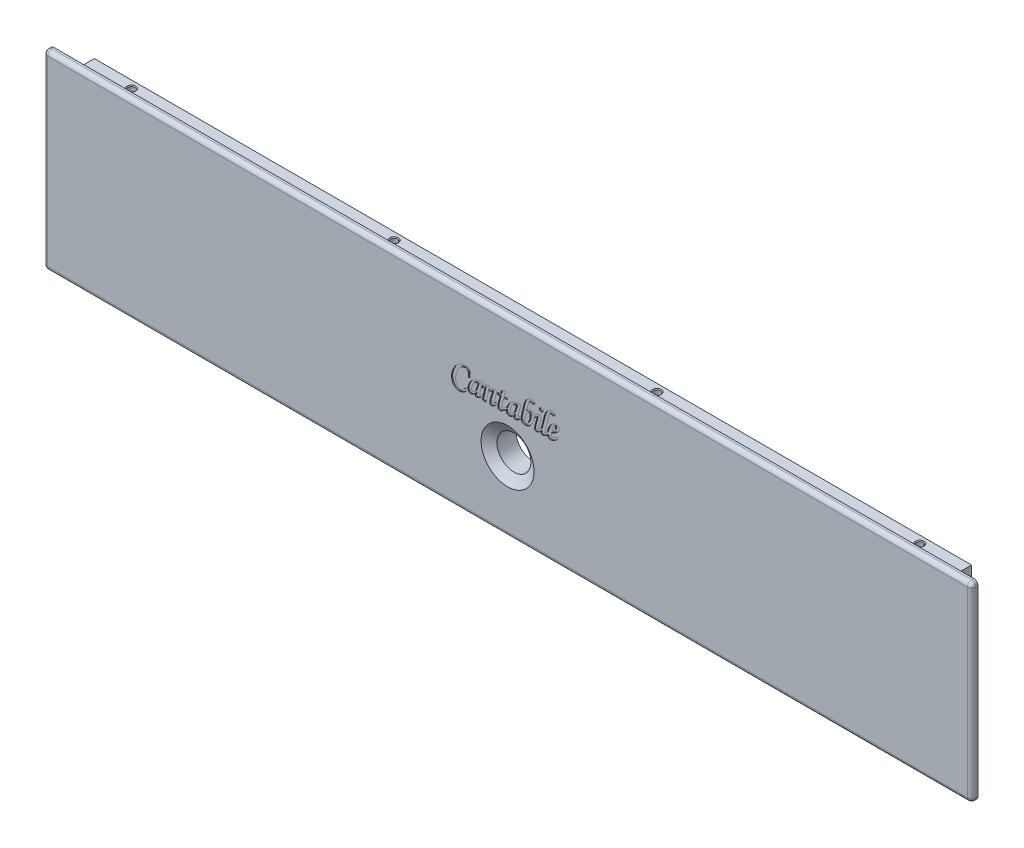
from build123d import *

# Parameters (mm, degrees)
SKETCH_1_W                     = 438
SKETCH_1_H                     = 90
EXTRUDE_1_DEPTH                = 12
SKETCH_3_W                     = 9
SKETCH_3_H                     = 4
CUT_EXTRUDE_1_DEPTH            = 448.311971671
HOLE_WIZARD_M1_6_1_D           = 16
HOLE_WIZARD_M1_6_1_CSINK_D     = 25
HOLE_WIZARD_M1_6_1_CSINK_ANGLE = 112.62
SKETCH_12_W                    = 12
SKETCH_12_H                    = 9
CUT_EXTRUDE_2_DEPTH            = 447.524355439
FILLET_1_R                     = 2
FILLET_2_R                     = 2
HOLE_WIZARD_M4_1_D             = 3.3
HOLE_WIZARD_M4_1_CSINK_D       = 4.05
HOLE_WIZARD_M4_1_CSINK_ANGLE   = 90
HOLE_WIZARD_M4_3_D             = 3.3
HOLE_WIZARD_M4_3_DEPTH         = 7.1
HOLE_WIZARD_M4_3_CSINK_D       = 4.05
HOLE_WIZARD_M4_3_CSINK_ANGLE   = 90
HOLE_WIZARD_M4_3_TIP           = 0.991420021
HOLE_WIZARD_M4_4_D             = 3.3
HOLE_WIZARD_M4_4_DEPTH         = 7.1
HOLE_WIZARD_M4_4_CSINK_D       = 4.05
HOLE_WIZARD_M4_4_CSINK_ANGLE   = 90
HOLE_WIZARD_M4_4_TIP           = 0.991420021
CUT_EXTRUDE_3_DEPTH            = 0.5


with BuildPart() as part:
    # Sketch 1 → Extrude 1 (new body)
    with BuildSketch(Plane.XY):
        with Locations((219, 45)):
            Rectangle(SKETCH_1_W, SKETCH_1_H)
    extrude(amount=EXTRUDE_1_DEPTH)

    # Sketch 3 → Cut-Extrude 1 (cut, through all)
    with BuildSketch(Plane(origin=(438, 0, 0), x_dir=(0, 0, -1), z_dir=(1, 0, 0))):
        with Locations((-4.5, 88)):
            Rectangle(SKETCH_3_W, SKETCH_3_H)
        with Locations((-4.5, 2)):
            Rectangle(SKETCH_3_W, SKETCH_3_H)
    extrude(amount=-CUT_EXTRUDE_1_DEPTH, mode=Mode.SUBTRACT)

    # Hole Wizard M1.6 _1 (through all)
    with Locations(Plane.XY.offset(12)):
        with Locations((219, 33)):
            CounterSinkHole(HOLE_WIZARD_M1_6_1_D / 2, HOLE_WIZARD_M1_6_1_CSINK_D / 2, counter_sink_angle=HOLE_WIZARD_M1_6_1_CSINK_ANGLE)

    # Sketch 12 → Cut-Extrude 2 (cut, through all)
    with BuildSketch(Plane(origin=(0, 86, 0), x_dir=(1, 0, 0), z_dir=(0, 1, 0))):
        with Locations((432, -4.5)):
            Rectangle(SKETCH_12_W, SKETCH_12_H)
        with Locations((6, -4.5)):
            Rectangle(SKETCH_12_W, SKETCH_12_H)
    extrude(amount=-CUT_EXTRUDE_2_DEPTH, mode=Mode.SUBTRACT)

    # Fillet 1
    fillet_1_edges = [part.edges().sort_by_distance(p)[0] for p in [
        (0, 90, 10.5),
        (438, 90, 10.5),
        (438, 0, 10.5),
        (0, 0, 10.5),
    ]]
    fillet(fillet_1_edges, radius=FILLET_1_R)

    # Fillet 2
    fillet_2_edges = [part.edges().sort_by_distance(p)[0] for p in [
        (0, 45, 12),
        (219, 90, 12),
        (219, 0, 12),
        (438, 45, 12),
        (437.414213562, 89.414213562, 12),
        (437.414213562, 0.585786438, 12),
        (0.585786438, 0.585786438, 12),
        (0.585786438, 89.414213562, 12),
    ]]
    fillet(fillet_2_edges, radius=FILLET_2_R)

    # Hole Wizard M4 _1 (through all)
    with Locations(Plane(origin=(0, 86, 0), x_dir=(1, 0, 0), z_dir=(0, 1, 0))):
        with Locations((405, -3.5), (281, -3.5), (157, -3.5), (33, -3.5)):
            CounterSinkHole(HOLE_WIZARD_M4_1_D / 2, HOLE_WIZARD_M4_1_CSINK_D / 2, counter_sink_angle=HOLE_WIZARD_M4_1_CSINK_ANGLE)

    # Hole Wizard M4 _3
    with Locations(Plane.ZY.offset(-12)):
        with Locations((3.5, 70), (3.5, 20)):
            CounterSinkHole(HOLE_WIZARD_M4_3_D / 2, HOLE_WIZARD_M4_3_CSINK_D / 2, depth=HOLE_WIZARD_M4_3_DEPTH, counter_sink_angle=HOLE_WIZARD_M4_3_CSINK_ANGLE)
            with Locations((0, 0, -(HOLE_WIZARD_M4_3_DEPTH + HOLE_WIZARD_M4_3_TIP / 2))):  # 118° drill point
                Cone(0, HOLE_WIZARD_M4_3_D / 2, HOLE_WIZARD_M4_3_TIP, mode=Mode.SUBTRACT)

    # Hole Wizard M4 _4
    with Locations(Plane(origin=(426, 0, 0), x_dir=(0, 0, -1), z_dir=(1, 0, 0))):
        with Locations((-3.5, 20), (-3.5, 70)):
            CounterSinkHole(HOLE_WIZARD_M4_4_D / 2, HOLE_WIZARD_M4_4_CSINK_D / 2, depth=HOLE_WIZARD_M4_4_DEPTH, counter_sink_angle=HOLE_WIZARD_M4_4_CSINK_ANGLE)
            with Locations((0, 0, -(HOLE_WIZARD_M4_4_DEPTH + HOLE_WIZARD_M4_4_TIP / 2))):  # 118° drill point
                Cone(0, HOLE_WIZARD_M4_4_D / 2, HOLE_WIZARD_M4_4_TIP, mode=Mode.SUBTRACT)

    # Sketch 23 → Cut-Extrude 3 (cut)
    # profile 1 of 5: a face of its own
    with BuildSketch(Plane.XY.offset(12)):
        with BuildLine():
            Line((201.30490828, 56.028755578), (200.519087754, 56.028755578))
            add(Edge.make_bspline(
                [(200.519087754, 56.028755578), (200.530581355, 56.265836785), (200.548333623, 56.668943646), (200.558478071, 57.072333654), (200.55875062, 57.23847298)],
                knots=[0, 0, 0, 0, 0.588272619, 1, 1, 1, 1], degree=3))
            add(Edge.make_bspline(
                [(200.55875062, 57.23847298), (200.555646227, 57.410313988), (200.550780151, 57.659691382), (200.498119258, 57.973898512), (200.448908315, 58.177807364), (200.388985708, 58.361507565), (200.30764224, 58.52069806), (200.217394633, 58.662228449), (200.073685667, 58.815623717), (199.870702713, 58.97285679), (199.491133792, 59.153887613), (199.172374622, 59.2017486), (198.957362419, 59.201784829)],
                knots=[0, 0, 0, 0, 0.178113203, 0.256952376, 0.329103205, 0.395063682, 0.456230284, 0.513605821, 0.568060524, 0.672873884, 0.7772506, 1, 1, 1, 1], degree=3))
            add(Edge.make_bspline(
                [(198.957362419, 59.201784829), (198.806636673, 59.200861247), (198.577458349, 59.175123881), (198.273875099, 59.100823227), (198.039405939, 59.016532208), (197.799226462, 58.912367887), (197.553167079, 58.786341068), (197.305721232, 58.632803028), (197.052151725, 58.461244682), (196.802187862, 58.260343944), (196.559138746, 58.031108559), (196.321767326, 57.774537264), (196.095393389, 57.486209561), (195.874632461, 57.170792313), (195.660964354, 56.827483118), (195.455639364, 56.454821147), (195.259714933, 56.058126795), (195.079190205, 55.645155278), (194.924085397, 55.223219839), (194.788656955, 54.798616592), (194.679697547, 54.368962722), (194.595249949, 53.935276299), (194.516503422, 53.350627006), (194.489548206, 52.908494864), (194.490332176, 52.612791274)],
                knots=[0, 0, 0, 0, 0.052156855, 0.079581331, 0.108100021, 0.138358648, 0.170238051, 0.203769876, 0.239183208, 0.27624507, 0.314723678, 0.35483516, 0.397217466, 0.441611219, 0.488158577, 0.537233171, 0.588954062, 0.641390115, 0.693288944, 0.744622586, 0.79572263, 0.846755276, 0.897603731, 1, 1, 1, 1], degree=3))
            add(Edge.make_bspline(
                [(194.490332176, 52.612791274), (194.490134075, 52.344665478), (194.50721326, 51.954486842), (194.573902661, 51.455500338), (194.643667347, 51.120864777), (194.731123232, 50.812268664), (194.842982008, 50.532214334), (194.972360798, 50.278408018), (195.120847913, 50.052582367), (195.28479549, 49.855708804), (195.454170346, 49.682450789), (195.630153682, 49.53483114), (195.814226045, 49.41509787), (196.005018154, 49.322189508), (196.267204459, 49.231663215), (196.474480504, 49.20556686), (196.612295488, 49.206742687)],
                knots=[0, 0, 0, 0, 0.180487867, 0.262449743, 0.338588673, 0.410403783, 0.478053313, 0.54123642, 0.601860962, 0.6595439, 0.71342533, 0.76476969, 0.813827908, 0.860841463, 0.907275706, 1, 1, 1, 1], degree=3))
            add(Edge.make_bspline(
                [(196.612295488, 49.206742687), (196.835872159, 49.20252221), (197.171411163, 49.2633343), (197.598472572, 49.43380235), (197.911636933, 49.622129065), (198.220978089, 49.856281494), (198.637575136, 50.257356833), (198.91644838, 50.610846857), (199.091224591, 50.867625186)],
                knots=[0, 0, 0, 0, 0.214883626, 0.325896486, 0.442525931, 0.566720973, 0.699958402, 1, 1, 1, 1], degree=3))
            add(Edge.make_bspline(
                [(199.091224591, 50.867625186), (199.142918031, 50.934532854), (199.245394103, 51.062496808), (199.402366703, 51.110246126), (199.472979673, 51.110560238)],
                knots=[0, 0, 0, 0, 0.550224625, 1, 1, 1, 1], degree=3))
            add(Edge.make_bspline(
                [(199.472979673, 51.110560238), (199.555481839, 51.113728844), (199.672737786, 51.096206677), (199.814234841, 51.038446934), (199.893738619, 50.975561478), (199.956273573, 50.909348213), (200.01794773, 50.833598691), (200.041090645, 50.769333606), (200.043133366, 50.728805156)],
                knots=[0, 0, 0, 0, 0.330206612, 0.471561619, 0.609116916, 0.733657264, 0.837987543, 1, 1, 1, 1], degree=3))
            add(Edge.make_bspline(
                [(200.043133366, 50.728805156), (200.039425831, 50.680241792), (200.018734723, 50.599739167), (199.960342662, 50.491171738), (199.900077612, 50.384479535), (199.816505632, 50.267483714), (199.719790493, 50.134020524), (199.602191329, 49.989147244), (199.425297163, 49.772803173), (199.170449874, 49.506835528), (198.826765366, 49.209094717), (198.44004023, 48.942115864), (198.021729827, 48.704343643), (197.582597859, 48.506863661), (196.99160356, 48.313242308), (196.532552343, 48.257179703), (196.230540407, 48.254833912)],
                knots=[0, 0, 0, 0, 0.030513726, 0.05137271, 0.077149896, 0.107337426, 0.141439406, 0.180531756, 0.224325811, 0.316698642, 0.4111346, 0.509039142, 0.610924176, 0.712533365, 0.810540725, 1, 1, 1, 1], degree=3))
            add(Edge.make_bspline(
                [(196.230540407, 48.254833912), (195.905779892, 48.252440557), (195.42006214, 48.319743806), (194.807098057, 48.540952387), (194.37144224, 48.770774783), (193.970490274, 49.06357864), (193.610525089, 49.41179005), (193.3027177, 49.818435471), (193.085559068, 50.195839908), (192.943638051, 50.523708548), (192.844605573, 50.78151579), (192.767886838, 51.052734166), (192.698486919, 51.333201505), (192.651192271, 51.62693592), (192.599699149, 52.038578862), (192.586852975, 52.354759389), (192.586514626, 52.56817055)],
                knots=[0, 0, 0, 0, 0.153719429, 0.229890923, 0.307833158, 0.386307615, 0.464392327, 0.544272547, 0.627223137, 0.670000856, 0.713491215, 0.757971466, 0.803462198, 0.85032415, 0.898841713, 1, 1, 1, 1], degree=3))
            add(Edge.make_bspline(
                [(192.586514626, 52.56817055), (192.585329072, 52.873314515), (192.619000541, 53.331584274), (192.712448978, 53.939669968), (192.818676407, 54.395057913), (192.948891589, 54.85126221), (193.114864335, 55.304358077), (193.304559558, 55.758781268), (193.525074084, 56.206289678), (193.764920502, 56.642545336), (194.026458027, 57.055462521), (194.297444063, 57.44716378), (194.589375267, 57.808176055), (194.891590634, 58.148073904), (195.21138616, 58.459282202), (195.544947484, 58.747011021), (195.893414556, 59.005042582), (196.247581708, 59.237116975), (196.603288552, 59.43814159), (196.955684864, 59.611532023), (197.308611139, 59.749654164), (197.658493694, 59.860568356), (198.120296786, 59.962052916), (198.470031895, 59.996665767), (198.702032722, 59.995042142)],
                knots=[0, 0, 0, 0, 0.08697536, 0.130883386, 0.175371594, 0.220281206, 0.266137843, 0.312937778, 0.360693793, 0.408384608, 0.454884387, 0.500072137, 0.544174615, 0.587241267, 0.629747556, 0.671371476, 0.712811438, 0.753347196, 0.792087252, 0.829302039, 0.865283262, 0.900100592, 0.933900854, 1, 1, 1, 1], degree=3))
            add(Edge.make_bspline(
                [(198.702032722, 59.995042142), (199.224348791, 59.998266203), (199.72830937, 59.86117997)],
                knots=[0, 0, 0, 1, 1, 1], degree=2))
            add(Edge.make_bspline(
                [(199.72830937, 59.86117997), (199.802987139, 59.836520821), (199.936473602, 59.79195767), (200.139594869, 59.711041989), (200.357194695, 59.628774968), (200.615362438, 59.52340952), (201.043654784, 59.345230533), (201.388108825, 59.206799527), (201.629647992, 59.102627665)],
                knots=[0, 0, 0, 0, 0.115251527, 0.206087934, 0.32030719, 0.456102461, 0.614614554, 1, 1, 1, 1], degree=3))
            add(Edge.make_bspline(
                [(201.629647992, 59.102627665), (201.530462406, 58.609178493), (201.378576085, 57.587680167), (201.318269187, 56.556865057), (201.30490828, 56.028755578)],
                knots=[0, 0, 0, 0, 0.487836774, 1, 1, 1, 1], degree=3))
        make_face()
    # profile 2 of 5: a face of its own
    with BuildSketch(Plane.XY.offset(12)):
        with BuildLine():
            Line((206.159271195, 57.196331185), (207.183068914, 57.278135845))
            Line((207.183068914, 57.278135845), (206.580689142, 55.064452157))
            add(Edge.make_bspline(
                [(206.580689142, 55.064452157), (206.456932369, 54.641142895), (206.220892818, 53.72832506), (206.018960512, 52.807402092), (205.921294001, 52.315319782)],
                knots=[0, 0, 0, 0, 0.467806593, 1, 1, 1, 1], degree=3))
            add(Edge.make_bspline(
                [(205.921294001, 52.315319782), (205.872676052, 52.093567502), (205.822666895, 51.793614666), (205.771404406, 51.465298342), (205.762357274, 51.360548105), (205.76064643, 51.333000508)],
                knots=[0, 0, 0, 0, 0.631671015, 0.847809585, 0.924693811, 0.924693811, 0.924693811, 0.924693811], degree=3))
            add(Edge.make_bspline(
                [(205.76064643, 51.333000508), (205.810027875, 51.366604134), (205.857031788, 51.402679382), (205.903941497, 51.440257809)],
                knots=[0.455856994, 0.455856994, 0.455856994, 0.455856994, 1, 1, 1, 1], degree=3))
            add(Edge.make_bspline(
                [(205.903941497, 51.440257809), (206.071465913, 51.572833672), (206.438969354, 51.879739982), (206.795414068, 52.199421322), (206.989712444, 52.379771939)],
                knots=[0, 0, 0, 0, 0.446233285, 1, 1, 1, 1], degree=3))
            Line((206.989712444, 52.379771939), (207.463187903, 51.730292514))
            add(Edge.make_bspline(
                [(207.463187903, 51.730292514), (207.313469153, 51.58922976), (207.103971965, 51.381946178), (206.828608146, 51.13037311), (206.65558396, 50.969294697), (206.498473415, 50.835050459), (206.335237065, 50.689194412), (206.216461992, 50.597737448), (206.14439762, 50.542885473)],
                knots=[0, 0, 0, 0, 0.347601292, 0.497779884, 0.630203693, 0.746966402, 0.846917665, 1, 1, 1, 1], degree=3))
            add(Edge.make_bspline(
                [(206.14439762, 50.542885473), (205.981875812, 50.424400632), (205.638003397, 50.213082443), (205.273340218, 50.039824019), (205.083415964, 49.970252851)],
                knots=[0, 0, 0, 0, 0.498683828, 1, 1, 1, 1], degree=3))
            add(Edge.make_bspline(
                [(205.083415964, 49.970252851), (204.74000185, 49.838608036), (204.371963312, 49.841348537)],
                knots=[0, 0, 0, 1, 1, 1], degree=2))
            add(Edge.make_bspline(
                [(204.371963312, 49.841348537), (204.289356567, 49.842030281), (204.168466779, 49.856187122), (204.026851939, 49.919285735), (203.939503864, 49.981856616), (203.873159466, 50.064875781), (203.8048703, 50.199918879), (203.794368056, 50.317864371), (203.791893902, 50.396628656)],
                knots=[0, 0, 0, 0, 0.27286591, 0.392020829, 0.506662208, 0.622488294, 0.737899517, 1, 1, 1, 1], degree=3))
            add(Edge.make_bspline(
                [(203.791893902, 50.396628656), (203.799824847, 50.59577256), (203.861303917, 50.785820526)],
                knots=[0, 0, 0, 1, 1, 1], degree=2))
            Line((203.861303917, 50.785820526), (204.181085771, 51.65840357))
            add(Edge.make_bspline(
                [(204.181085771, 51.65840357), (204.130675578, 51.527074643), (204.030875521, 51.334117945), (203.853417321, 51.098302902), (203.696725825, 50.917687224), (203.512047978, 50.743592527), (203.227953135, 50.502595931), (202.988162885, 50.342195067), (202.820153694, 50.237977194)],
                knots=[0, 0, 0, 0, 0.210843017, 0.32331976, 0.441828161, 0.568860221, 0.703355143, 1, 1, 1, 1], degree=3))
            add(Edge.make_bspline(
                [(202.820153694, 50.237977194), (202.6222574, 50.115042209), (202.217559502, 49.915326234), (201.771907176, 49.840922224), (201.55837878, 49.841348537)],
                knots=[0, 0, 0, 0, 0.522664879, 1, 1, 1, 1], degree=3))
            add(Edge.make_bspline(
                [(201.55837878, 49.841348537), (201.391424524, 49.840922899), (201.060374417, 49.896017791), (200.794610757, 50.102919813), (200.700669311, 50.230540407)],
                knots=[0, 0, 0, 0, 0.515349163, 1, 1, 1, 1], degree=3))
            add(Edge.make_bspline(
                [(200.700669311, 50.230540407), (200.573447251, 50.395213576), (200.369839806, 50.798628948), (200.327612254, 51.24792442), (200.323872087, 51.482399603)],
                knots=[0, 0, 0, 0, 0.46856765, 1, 1, 1, 1], degree=3))
            add(Edge.make_bspline(
                [(200.323872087, 51.482399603), (200.323339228, 51.79707585), (200.395255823, 52.282088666), (200.585084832, 52.931222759), (200.793891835, 53.447217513), (201.047059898, 53.96382707), (201.346411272, 54.461622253), (201.684472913, 54.934285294), (202.058639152, 55.375815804), (202.455123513, 55.78126462), (202.999817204, 56.2384783), (203.442054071, 56.516166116), (203.749752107, 56.65840357)],
                knots=[0, 0, 0, 0, 0.145247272, 0.225742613, 0.312612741, 0.40259362, 0.49180944, 0.581185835, 0.671302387, 0.759478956, 0.843374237, 1, 1, 1, 1], degree=3))
            add(Edge.make_bspline(
                [(203.749752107, 56.65840357), (204.002005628, 56.77470458), (204.586711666, 56.942761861), (205.193123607, 56.979897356), (205.519707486, 56.980664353)],
                knots=[0, 0, 0, 0, 0.458723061, 1, 1, 1, 1], degree=3))
            add(Edge.make_bspline(
                [(205.519707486, 56.980664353), (205.750527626, 56.982241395), (205.97830937, 56.945959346)],
                knots=[0, 0, 0, 1, 1, 1], degree=2))
            Line((205.97830937, 56.945959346), (206.159271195, 57.196331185))
        make_face()
        with BuildLine():
            Line((204.411626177, 53.3986118), (205.080937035, 55.659395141))
            add(Edge.make_bspline(
                [(205.080937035, 55.659395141), (204.793179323, 55.711175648), (204.500867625, 55.711452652)],
                knots=[0, 0, 0, 1, 1, 1], degree=2))
            add(Edge.make_bspline(
                [(204.500867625, 55.711452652), (204.312313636, 55.713209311), (204.030032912, 55.672953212), (203.681450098, 55.531619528), (203.478561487, 55.410345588), (203.322587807, 55.289958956), (203.209631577, 55.172884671), (203.093429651, 55.040595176), (202.977981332, 54.886128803), (202.863261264, 54.712141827), (202.74906811, 54.517280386), (202.634692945, 54.303229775), (202.484968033, 53.993995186), (202.320451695, 53.59238446), (202.126821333, 52.941358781), (202.072095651, 52.438490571), (202.069038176, 52.107089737)],
                knots=[0, 0, 0, 0, 0.118489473, 0.176751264, 0.235458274, 0.266529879, 0.300322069, 0.337509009, 0.377195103, 0.421424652, 0.468462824, 0.519124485, 0.573952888, 0.684400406, 0.791573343, 1, 1, 1, 1], degree=3))
            add(Edge.make_bspline(
                [(202.069038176, 52.107089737), (202.067781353, 51.962665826), (202.077786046, 51.766655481), (202.130912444, 51.537189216), (202.18753678, 51.428850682), (202.251746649, 51.35809614), (202.326583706, 51.298817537), (202.385125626, 51.268114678), (202.426003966, 51.269211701)],
                knots=[0, 0, 0, 0, 0.437940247, 0.593618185, 0.710268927, 0.804374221, 0.88111538, 1, 1, 1, 1], degree=3))
            add(Edge.make_bspline(
                [(202.426003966, 51.269211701), (202.609630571, 51.269852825), (202.892411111, 51.359279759), (203.248993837, 51.576498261), (203.484716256, 51.76853453), (203.673670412, 51.951489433), (203.808199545, 52.112915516), (203.934181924, 52.288488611), (204.051289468, 52.479348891), (204.154962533, 52.687627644), (204.286814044, 52.990785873), (204.365507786, 53.232427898), (204.411626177, 53.3986118)],
                knots=[0, 0, 0, 0, 0.17589848, 0.282286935, 0.403702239, 0.470012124, 0.537126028, 0.60719005, 0.679492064, 0.754046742, 0.832661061, 1, 1, 1, 1], degree=3))
        make_face(mode=Mode.SUBTRACT)
    # profile 3 of 5: a face of its own
    with BuildSketch(Plane.XY.offset(12)):
        with BuildLine():
            Line((207.089489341, 54.759543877), (206.782102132, 55.436291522))
            add(Edge.make_bspline(
                [(206.782102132, 55.436291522), (206.955830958, 55.612919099), (207.210297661, 55.864464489), (207.54865741, 56.175588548), (207.777144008, 56.375387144), (207.99205753, 56.550771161), (208.192869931, 56.702260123), (208.378809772, 56.831335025), (208.604016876, 56.964404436), (208.865645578, 57.093774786), (209.242189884, 57.242557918), (209.525123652, 57.296837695), (209.704759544, 57.297967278)],
                knots=[0, 0, 0, 0, 0.209677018, 0.302722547, 0.388965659, 0.466508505, 0.537417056, 0.601812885, 0.65793967, 0.758640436, 0.84850992, 1, 1, 1, 1], degree=3))
            add(Edge.make_bspline(
                [(209.704759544, 57.297967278), (209.802317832, 57.302398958), (209.940171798, 57.282140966), (210.11092719, 57.227489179), (210.209162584, 57.162633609), (210.289464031, 57.096160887), (210.363056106, 57.01198892), (210.395993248, 56.941470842), (210.396380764, 56.893901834)],
                knots=[0, 0, 0, 0, 0.334780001, 0.480259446, 0.615020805, 0.738663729, 0.839994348, 1, 1, 1, 1], degree=3))
            add(Edge.make_bspline(
                [(210.396380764, 56.893901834), (210.396210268, 56.857977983), (210.380018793, 56.757434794), (210.357295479, 56.658497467), (210.344323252, 56.593951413)],
                knots=[0, 0, 0, 0, 0.352433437, 1, 1, 1, 1], degree=3))
            Line((210.344323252, 56.593951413), (209.977441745, 55.123946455))
            add(Edge.make_bspline(
                [(209.977441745, 55.123946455), (210.044245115, 55.28126459), (210.179312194, 55.506930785), (210.397462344, 55.792367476), (210.59010605, 56.010738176), (210.813545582, 56.222708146), (211.149481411, 56.518571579), (211.435972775, 56.713058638), (211.630887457, 56.846802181)],
                knots=[0, 0, 0, 0, 0.211404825, 0.324738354, 0.445234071, 0.572051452, 0.706426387, 1, 1, 1, 1], degree=3))
            add(Edge.make_bspline(
                [(211.630887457, 56.846802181), (211.835663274, 56.976953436), (212.207378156, 57.190620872), (212.624547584, 57.297828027), (212.80837878, 57.297967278)],
                knots=[0, 0, 0, 0, 0.571537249, 1, 1, 1, 1], degree=3))
            add(Edge.make_bspline(
                [(212.80837878, 57.297967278), (212.958078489, 57.301128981), (213.174799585, 57.270150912), (213.423168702, 57.140127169), (213.559415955, 57.004885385), (213.663115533, 56.847227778), (213.766400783, 56.61102117), (213.792080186, 56.415397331), (213.792513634, 56.284085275)],
                knots=[0, 0, 0, 0, 0.281054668, 0.400985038, 0.519313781, 0.636613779, 0.753174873, 1, 1, 1, 1], degree=3))
            add(Edge.make_bspline(
                [(213.792513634, 56.284085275), (213.782607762, 55.972166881), (213.705751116, 55.669310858)],
                knots=[0, 0, 0, 1, 1, 1], degree=2))
            add(Edge.make_bspline(
                [(213.705751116, 55.669310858), (213.673931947, 55.567222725), (213.623799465, 55.389310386), (213.539543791, 55.123154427), (213.455290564, 54.854027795), (213.360054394, 54.538238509), (213.195123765, 54.029025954), (213.073980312, 53.621131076), (212.979424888, 53.336638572)],
                knots=[0, 0, 0, 0, 0.131296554, 0.226930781, 0.34278128, 0.477578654, 0.631926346, 1, 1, 1, 1], degree=3))
            add(Edge.make_bspline(
                [(212.979424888, 53.336638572), (212.89831892, 53.090083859), (212.789053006, 52.7352614), (212.659328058, 52.283264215), (212.583859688, 51.995025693), (212.527093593, 51.739307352), (212.475225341, 51.473258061), (212.45303368, 51.29037525), (212.451552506, 51.182110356)],
                knots=[0, 0, 0, 0, 0.346710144, 0.495908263, 0.628166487, 0.744662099, 0.845764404, 0.990231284, 0.990231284, 0.990231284, 0.990231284], degree=3))
            add(Edge.make_bspline(
                [(212.451552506, 51.182110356), (212.471197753, 51.197763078), (212.614932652, 51.327883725), (212.736891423, 51.471047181), (212.845562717, 51.598909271)],
                knots=[0.225460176, 0.225460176, 0.225460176, 0.225460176, 0.326775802, 1, 1, 1, 1], degree=3))
            add(Edge.make_bspline(
                [(212.845562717, 51.598909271), (212.966219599, 51.738039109), (213.259856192, 52.027685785), (213.603314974, 52.256207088), (213.792513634, 52.379771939)],
                knots=[0, 0, 0, 0, 0.448624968, 1, 1, 1, 1], degree=3))
            Line((213.792513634, 52.379771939), (214.089985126, 51.735250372))
            add(Edge.make_bspline(
                [(214.089985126, 51.735250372), (213.836155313, 51.435344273), (213.312417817, 50.883834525), (212.716962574, 50.410247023), (212.411750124, 50.208230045)],
                knots=[0, 0, 0, 0, 0.517912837, 1, 1, 1, 1], degree=3))
            add(Edge.make_bspline(
                [(212.411750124, 50.208230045), (212.248153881, 50.096726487), (211.926167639, 49.920579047), (211.566981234, 49.839760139), (211.40034705, 49.841348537)],
                knots=[0, 0, 0, 0, 0.544886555, 1, 1, 1, 1], degree=3))
            add(Edge.make_bspline(
                [(211.40034705, 49.841348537), (211.286255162, 49.844560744), (211.111833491, 49.865787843), (210.920423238, 49.983786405), (210.799756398, 50.097307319), (210.707120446, 50.248564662), (210.6177547, 50.512761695), (210.598610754, 50.734405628), (210.59965295, 50.889935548)],
                knots=[0, 0, 0, 0, 0.231554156, 0.337567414, 0.445115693, 0.560221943, 0.688302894, 1, 1, 1, 1], degree=3))
            add(Edge.make_bspline(
                [(210.59965295, 50.889935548), (210.602694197, 50.964353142), (210.608181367, 51.084965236), (210.635018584, 51.256308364), (210.662172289, 51.409875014), (210.693998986, 51.581390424), (210.737312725, 51.768573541), (210.785439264, 51.974106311), (210.847181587, 52.194559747), (210.910429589, 52.433086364), (210.983025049, 52.688231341), (211.061420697, 52.961452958), (211.152051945, 53.249745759), (211.244836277, 53.556445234), (211.390073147, 53.996721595), (211.495917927, 54.337909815), (211.576351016, 54.568666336)],
                knots=[0, 0, 0, 0, 0.058623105, 0.094739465, 0.136297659, 0.181285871, 0.231892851, 0.287371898, 0.347272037, 0.41190247, 0.481436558, 0.555880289, 0.635427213, 0.719082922, 0.807859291, 1, 1, 1, 1], degree=3))
            add(Edge.make_bspline(
                [(211.576351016, 54.568666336), (211.620754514, 54.720278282), (211.682142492, 54.933827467), (211.751691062, 55.201779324), (211.796501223, 55.359380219), (211.82372961, 55.492782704), (211.855068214, 55.612785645), (211.865572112, 55.691352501), (211.86886465, 55.733763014)],
                knots=[0, 0, 0, 0, 0.394215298, 0.55424526, 0.690768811, 0.802804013, 0.893822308, 1, 1, 1, 1], degree=3))
            add(Edge.make_bspline(
                [(211.86886465, 55.733763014), (211.871911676, 55.769339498), (211.85112756, 55.846939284), (211.775299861, 55.875211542), (211.739960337, 55.870104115)],
                knots=[0, 0, 0, 0, 0.507504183, 1, 1, 1, 1], degree=3))
            add(Edge.make_bspline(
                [(211.739960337, 55.870104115), (211.653096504, 55.864523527), (211.433060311, 55.770635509), (211.240360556, 55.634093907), (211.115270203, 55.550322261)],
                knots=[0, 0, 0, 0, 0.362826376, 1, 1, 1, 1], degree=3))
            add(Edge.make_bspline(
                [(211.115270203, 55.550322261), (210.901680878, 55.39643834), (210.48136028, 55.041768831), (210.140310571, 54.610372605), (209.974962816, 54.380267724)],
                knots=[0, 0, 0, 0, 0.4813968, 1, 1, 1, 1], degree=3))
            add(Edge.make_bspline(
                [(209.974962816, 54.380267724), (209.924753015, 54.310628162), (209.861143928, 54.188932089), (209.782744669, 54.011137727), (209.723735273, 53.849520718), (209.667433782, 53.667938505), (209.58866111, 53.388657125), (209.532920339, 53.168614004), (209.501487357, 53.014377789)],
                knots=[0, 0, 0, 0, 0.176645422, 0.282814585, 0.401005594, 0.531560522, 0.675189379, 1, 1, 1, 1], degree=3))
            Line((209.501487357, 53.014377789), (208.844571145, 50))
            Line((208.844571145, 50), (207.109320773, 50))
            add(Edge.make_bspline(
                [(207.109320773, 50), (207.211995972, 50.453592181), (207.408125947, 51.309131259), (207.593095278, 52.167151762), (207.679474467, 52.570649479)],
                knots=[0, 0, 0, 0, 0.529866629, 1, 1, 1, 1], degree=3))
            Line((207.679474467, 52.570649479), (208.371095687, 55.721368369))
            add(Edge.make_bspline(
                [(208.371095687, 55.721368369), (208.40219151, 55.841120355), (208.410758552, 55.964303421)],
                knots=[0, 0, 0, 1, 1, 1], degree=2))
            add(Edge.make_bspline(
                [(208.410758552, 55.964303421), (208.416070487, 55.976510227), (208.414728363, 55.998305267), (208.410647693, 56.014321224)],
                knots=[0, 0, 0, 0, 0.766733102, 0.766733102, 0.766733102, 0.766733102], degree=3))
            add(Edge.make_bspline(
                [(208.410647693, 56.014321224), (208.409348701, 56.003237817), (208.332177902, 55.943459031), (208.310841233, 55.888561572), (208.242191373, 55.845314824)],
                knots=[0.061744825, 0.061744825, 0.061744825, 0.061744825, 0.212650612, 1, 1, 1, 1], degree=3))
            add(Edge.make_bspline(
                [(208.242191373, 55.845314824), (208.073094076, 55.699151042), (207.680526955, 55.345889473), (207.305936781, 54.973583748), (207.089489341, 54.759543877)],
                knots=[0, 0, 0, 0, 0.423353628, 1, 1, 1, 1], degree=3))
        make_face()
    # profile 4 of 5: a face of its own
    with BuildSketch(Plane.XY.offset(12)):
        with BuildLine():
            Line((216.133242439, 58.443232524), (218.051933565, 59.117501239))
            Line((218.051933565, 59.117501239), (217.442117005, 56.82201289))
            Line((217.442117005, 56.82201289), (218.971616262, 56.82201289))
            Line((218.971616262, 56.82201289), (218.808006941, 55.870104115))
            Line((218.808006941, 55.870104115), (217.258676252, 55.870104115))
            Line((217.258676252, 55.870104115), (216.569533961, 53.182944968))
            add(Edge.make_bspline(
                [(216.569533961, 53.182944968), (216.501875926, 53.002469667), (216.419763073, 52.738511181), (216.311934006, 52.404504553), (216.256461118, 52.185987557), (216.207288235, 51.991719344), (216.167980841, 51.776146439), (216.149128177, 51.625224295), (216.148116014, 51.531978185)],
                knots=[0, 0, 0, 0, 0.337956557, 0.485177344, 0.615659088, 0.733473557, 0.83670738, 1, 1, 1, 1], degree=3))
            add(Edge.make_bspline(
                [(216.148116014, 51.531978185), (216.150254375, 51.477309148), (216.148980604, 51.406951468), (216.161528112, 51.3256617), (216.169554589, 51.292533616), (216.175372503, 51.273007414), (216.182821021, 51.269211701)],
                knots=[0, 0, 0, 0, 0.610350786, 0.788012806, 0.911532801, 1, 1, 1, 1], degree=3))
            add(Edge.make_bspline(
                [(216.182821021, 51.269211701), (216.28148923, 51.272494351), (216.523046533, 51.368662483), (216.739865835, 51.505928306), (216.871963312, 51.596430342)],
                knots=[0, 0, 0, 0, 0.37776141, 1, 1, 1, 1], degree=3))
            add(Edge.make_bspline(
                [(216.871963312, 51.596430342), (217.113217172, 51.764334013), (217.622850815, 52.124755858), (218.121712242, 52.499938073), (218.386588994, 52.697074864)],
                knots=[0, 0, 0, 0, 0.470950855, 1, 1, 1, 1], degree=3))
            Line((218.386588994, 52.697074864), (218.586060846, 52.447260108))
            add(Edge.make_bspline(
                [(218.586060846, 52.447260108), (218.62503167, 52.605285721), (218.724531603, 52.941653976), (218.929117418, 53.447217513), (219.182285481, 53.96382707), (219.481636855, 54.461622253), (219.819698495, 54.934285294), (220.193864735, 55.375815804), (220.590349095, 55.78126462), (221.135042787, 56.2384783), (221.577279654, 56.516166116), (221.88497769, 56.65840357)],
                knots=[0.150449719, 0.150449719, 0.150449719, 0.150449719, 0.225742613, 0.312612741, 0.40259362, 0.49180944, 0.581185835, 0.671302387, 0.759478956, 0.843374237, 1, 1, 1, 1], degree=3))
            add(Edge.make_bspline(
                [(221.88497769, 56.65840357), (222.137231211, 56.77470458), (222.721937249, 56.942761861), (223.32834919, 56.979897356), (223.654933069, 56.980664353)],
                knots=[0, 0, 0, 0, 0.458723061, 1, 1, 1, 1], degree=3))
            add(Edge.make_bspline(
                [(223.654933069, 56.980664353), (223.885753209, 56.982241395), (224.113534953, 56.945959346)],
                knots=[0, 0, 0, 1, 1, 1], degree=2))
            Line((224.113534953, 56.945959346), (224.294496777, 57.196331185))
            Line((224.294496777, 57.196331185), (225.318294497, 57.278135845))
            Line((225.318294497, 57.278135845), (224.715914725, 55.064452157))
            add(Edge.make_bspline(
                [(224.715914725, 55.064452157), (224.592157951, 54.641142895), (224.3561184, 53.72832506), (224.154186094, 52.807402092), (224.056519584, 52.315319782)],
                knots=[0, 0, 0, 0, 0.467806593, 1, 1, 1, 1], degree=3))
            add(Edge.make_bspline(
                [(224.056519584, 52.315319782), (224.007901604, 52.093567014), (223.957892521, 51.793615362), (223.906629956, 51.465297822), (223.897582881, 51.360548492), (223.895872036, 51.333000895)],
                knots=[0, 0, 0, 0, 0.631671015, 0.847809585, 0.924693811, 0.924693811, 0.924693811, 0.924693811], degree=3))
            add(Edge.make_bspline(
                [(223.895872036, 51.333000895), (223.945253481, 51.366604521), (223.992257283, 51.402677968), (224.03916708, 51.440257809)],
                knots=[0.455856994, 0.455856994, 0.455856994, 0.455856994, 1, 1, 1, 1], degree=3))
            add(Edge.make_bspline(
                [(224.03916708, 51.440257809), (224.206691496, 51.572833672), (224.574194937, 51.879739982), (224.93063965, 52.199421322), (225.124938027, 52.379771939)],
                knots=[0, 0, 0, 0, 0.446233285, 1, 1, 1, 1], degree=3))
            Line((225.124938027, 52.379771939), (225.422485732, 51.971617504))
            add(Edge.make_bspline(
                [(225.422485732, 51.971617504), (225.432112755, 52.080702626), (225.481328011, 52.497988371), (225.566312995, 52.909849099), (225.633738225, 53.212692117)],
                knots=[0.229731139, 0.229731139, 0.229731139, 0.229731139, 0.430596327, 1, 1, 1, 1], degree=3))
            Line((225.633738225, 53.212692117), (226.620352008, 57.548339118))
            add(Edge.make_bspline(
                [(226.620352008, 57.548339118), (226.674955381, 57.803389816), (226.768919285, 58.171711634), (226.910902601, 58.643801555), (227.022968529, 58.96339029), (227.138446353, 59.260727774), (227.259816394, 59.533831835), (227.386023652, 59.783646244), (227.563811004, 60.082585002), (227.811151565, 60.425368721), (228.156146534, 60.790582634), (228.542402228, 61.116451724), (228.968138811, 61.388634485), (229.406544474, 61.611884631), (229.97324444, 61.825787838), (230.409139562, 61.899105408), (230.693232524, 61.898859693)],
                knots=[0, 0, 0, 0, 0.121018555, 0.176334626, 0.228726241, 0.278146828, 0.324324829, 0.36737141, 0.40794907, 0.485650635, 0.562968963, 0.64054552, 0.719575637, 0.796920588, 0.868508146, 1, 1, 1, 1], degree=3))
            add(Edge.make_bspline(
                [(230.693232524, 61.898859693), (230.873100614, 61.896661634), (231.131122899, 61.881302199), (231.436182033, 61.773024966), (231.606577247, 61.664306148), (231.740472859, 61.539759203), (231.868358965, 61.359135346), (231.907082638, 61.199456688), (231.907907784, 61.095686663)],
                knots=[0, 0, 0, 0, 0.334479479, 0.471389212, 0.594410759, 0.705823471, 0.808042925, 1, 1, 1, 1], degree=3))
            add(Edge.make_bspline(
                [(231.907907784, 61.095686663), (231.907172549, 60.999753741), (231.871155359, 60.851752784), (231.756706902, 60.679823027), (231.64100665, 60.55334726), (231.49244347, 60.442673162), (231.232958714, 60.335271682), (231.013783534, 60.311158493), (230.861799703, 60.312345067)],
                knots=[0, 0, 0, 0, 0.198089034, 0.305662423, 0.424145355, 0.551255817, 0.685175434, 1, 1, 1, 1], degree=3))
            add(Edge.make_bspline(
                [(230.861799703, 60.312345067), (230.735806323, 60.314737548), (230.423458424, 60.340311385), (230.114496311, 60.392421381), (229.92972236, 60.421417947)],
                knots=[0, 0, 0, 0, 0.402359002, 1, 1, 1, 1], degree=3))
            add(Edge.make_bspline(
                [(229.92972236, 60.421417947), (229.691371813, 60.467326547), (229.448810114, 60.470996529)],
                knots=[0, 0, 0, 1, 1, 1], degree=2))
            add(Edge.make_bspline(
                [(229.448810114, 60.470996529), (229.378916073, 60.468992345), (229.229535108, 60.366876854), (229.135022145, 60.218490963), (229.079449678, 60.126425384)],
                knots=[0, 0, 0, 0, 0.381958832, 1, 1, 1, 1], degree=3))
            add(Edge.make_bspline(
                [(229.079449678, 60.126425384), (229.047337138, 60.064091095), (229.002687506, 59.950954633), (228.943318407, 59.77729347), (228.893507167, 59.596519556), (228.829471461, 59.385442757), (228.740228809, 59.035361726), (228.671473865, 58.756574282), (228.623326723, 58.559742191)],
                knots=[0, 0, 0, 0, 0.128554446, 0.22306559, 0.336847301, 0.47271789, 0.628002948, 1, 1, 1, 1], degree=3))
            Line((228.623326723, 58.559742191), (227.837506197, 55.882498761))
            add(Edge.make_bspline(
                [(227.837506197, 55.882498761), (227.914508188, 56.108399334), (228.100933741, 56.420391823), (228.454643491, 56.75075987), (228.767296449, 56.945070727), (229.09456862, 57.093881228), (229.496060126, 57.245184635), (229.800071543, 57.297084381), (229.994174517, 57.297967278)],
                knots=[0, 0, 0, 0, 0.261534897, 0.392044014, 0.528917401, 0.664286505, 0.787022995, 1, 1, 1, 1], degree=3))
            add(Edge.make_bspline(
                [(229.994174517, 57.297967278), (230.117805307, 57.298645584), (230.299381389, 57.28517465), (230.529246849, 57.227118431), (230.684887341, 57.168146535), (230.828972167, 57.092484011), (230.961025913, 57.000596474), (231.081077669, 56.890503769), (231.223954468, 56.718578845), (231.377331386, 56.467933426), (231.485110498, 56.162956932), (231.529779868, 55.960108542), (231.544350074, 55.876257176)],
                knots=[0, 0, 0, 0, 0.127475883, 0.186317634, 0.243706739, 0.298538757, 0.353562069, 0.408992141, 0.465778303, 0.583449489, 0.709487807, 0.797100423, 0.797100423, 0.797100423, 0.797100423], degree=3))
            add(Edge.make_bspline(
                [(231.544350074, 55.876257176), (231.610219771, 55.946214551), (231.744895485, 56.08543282), (231.949486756, 56.283984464), (232.155312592, 56.465350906), (232.355926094, 56.624930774), (232.552210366, 56.760945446), (232.797318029, 56.913693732), (233.09230514, 57.06047172), (233.516153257, 57.233287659), (233.835608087, 57.294337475), (234.037927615, 57.297967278)],
                knots=[0.19340063, 0.19340063, 0.19340063, 0.19340063, 0.272430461, 0.352700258, 0.427824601, 0.497985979, 0.563408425, 0.624140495, 0.735386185, 0.83395546, 1, 1, 1, 1], degree=3))
            add(Edge.make_bspline(
                [(234.037927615, 57.297967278), (234.165385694, 57.294961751), (234.352533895, 57.283367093), (234.571798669, 57.195866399), (234.700193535, 57.111035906), (234.797640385, 57.011408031), (234.898466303, 56.877384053), (234.92577792, 56.755728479), (234.927863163, 56.678235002)],
                knots=[0, 0, 0, 0, 0.320668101, 0.458524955, 0.584923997, 0.701577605, 0.805138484, 1, 1, 1, 1], degree=3))
            add(Edge.make_bspline(
                [(234.927863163, 56.678235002), (234.925297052, 56.605244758), (234.897834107, 56.472452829), (234.853444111, 56.261877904), (234.794773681, 56.029368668), (234.723139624, 55.746726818), (234.598284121, 55.268226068), (234.491929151, 54.885409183), (234.414724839, 54.61328706)],
                knots=[0, 0, 0, 0, 0.102509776, 0.190648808, 0.303308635, 0.440250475, 0.601482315, 1, 1, 1, 1], degree=3))
            add(Edge.make_bspline(
                [(234.414724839, 54.61328706), (234.350994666, 54.387358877), (234.261996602, 54.056542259), (234.145717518, 53.626795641), (234.066702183, 53.331112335), (233.994113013, 53.052809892), (233.930525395, 52.792097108), (233.869973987, 52.549610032), (233.818593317, 52.323663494), (233.771472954, 52.115439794), (233.728659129, 51.92487736), (233.693929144, 51.75213063), (233.666827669, 51.596593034), (233.643736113, 51.459619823), (233.629217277, 51.338782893), (233.620015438, 51.251917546), (233.617485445, 51.204675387), (233.617040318, 51.192220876)],
                knots=[0, 0, 0, 0, 0.197612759, 0.288396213, 0.374787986, 0.455267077, 0.530513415, 0.600698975, 0.665664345, 0.725572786, 0.780425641, 0.830083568, 0.873885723, 0.913340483, 0.946990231, 0.976338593, 0.98683136, 0.98683136, 0.98683136, 0.98683136], degree=3))
            add(Edge.make_bspline(
                [(233.617040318, 51.192220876), (233.657540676, 51.223677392), (233.749898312, 51.298763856), (233.89950316, 51.439063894), (234.08278257, 51.617618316), (234.393414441, 51.931981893), (234.635404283, 52.193856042), (234.808874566, 52.379771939)],
                knots=[0.092391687, 0.092391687, 0.092391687, 0.092391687, 0.174867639, 0.28551241, 0.42346899, 0.588815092, 1, 1, 1, 1], degree=3))
            Line((234.808874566, 52.379771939), (234.924204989, 52.245823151))
            add(Edge.make_bspline(
                [(234.924204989, 52.245823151), (234.941680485, 52.325280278), (235.030898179, 52.716103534), (235.12410569, 53.105898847), (235.201165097, 53.415964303)],
                knots=[0.564179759, 0.564179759, 0.564179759, 0.564179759, 0.652637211, 1, 1, 1, 1], degree=3))
            Line((235.201165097, 53.415964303), (236.083663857, 57.020327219))
            add(Edge.make_bspline(
                [(236.083663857, 57.020327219), (236.158547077, 57.321795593), (236.268676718, 57.754241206), (236.421574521, 58.301814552), (236.523463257, 58.654037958), (236.627602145, 58.964279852), (236.740835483, 59.303405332), (236.838013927, 59.532813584), (236.90418939, 59.670302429)],
                knots=[0, 0, 0, 0, 0.335474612, 0.481830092, 0.613969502, 0.731359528, 0.835209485, 1, 1, 1, 1], degree=3))
            add(Edge.make_bspline(
                [(236.90418939, 59.670302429), (236.988145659, 59.844025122), (237.136533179, 60.090178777), (237.35955331, 60.397372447), (237.537538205, 60.611940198), (237.733162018, 60.808369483), (237.940878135, 60.991537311), (238.162267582, 61.161482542), (238.39740169, 61.313053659), (238.638816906, 61.452542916), (238.886758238, 61.571501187), (239.139284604, 61.670393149), (239.392785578, 61.755237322), (239.650353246, 61.820647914), (239.998944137, 61.87922051), (240.264181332, 61.898431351), (240.44162122, 61.898859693)],
                knots=[0, 0, 0, 0, 0.131334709, 0.195420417, 0.258576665, 0.321089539, 0.384125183, 0.447193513, 0.511071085, 0.574627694, 0.637087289, 0.698256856, 0.75933305, 0.819150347, 0.879137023, 1, 1, 1, 1], degree=3))
            add(Edge.make_bspline(
                [(240.44162122, 61.898859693), (240.595293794, 61.898007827), (240.819947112, 61.878750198), (241.08189716, 61.764938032), (241.235306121, 61.655614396), (241.356290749, 61.529725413), (241.472026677, 61.358554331), (241.513727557, 61.213380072), (241.512518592, 61.117997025)],
                knots=[0, 0, 0, 0, 0.316498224, 0.451231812, 0.57974579, 0.699298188, 0.806661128, 1, 1, 1, 1], degree=3))
            add(Edge.make_bspline(
                [(241.512518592, 61.117997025), (241.514442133, 61.018058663), (241.479743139, 60.86615593), (241.372707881, 60.685262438), (241.261673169, 60.556922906), (241.117796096, 60.443642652), (240.858184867, 60.333143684), (240.635545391, 60.311362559), (240.481284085, 60.312345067)],
                knots=[0, 0, 0, 0, 0.203742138, 0.311436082, 0.427822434, 0.549691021, 0.683041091, 1, 1, 1, 1], degree=3))
            add(Edge.make_bspline(
                [(240.481284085, 60.312345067), (240.38250717, 60.311963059), (240.154909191, 60.332537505), (239.931402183, 60.379201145), (239.80453644, 60.404065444)],
                knots=[0, 0, 0, 0, 0.432740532, 1, 1, 1, 1], degree=3))
            add(Edge.make_bspline(
                [(239.80453644, 60.404065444), (239.48654949, 60.467161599), (239.162493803, 60.470996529)],
                knots=[0, 0, 0, 1, 1, 1], degree=2))
            add(Edge.make_bspline(
                [(239.162493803, 60.470996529), (239.011516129, 60.470622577), (238.897248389, 60.371839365)],
                knots=[0, 0, 0, 1, 1, 1], degree=2))
            add(Edge.make_bspline(
                [(238.897248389, 60.371839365), (238.83354696, 60.306973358), (238.766362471, 60.156148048), (238.677959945, 59.914619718), (238.611297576, 59.69769683), (238.551249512, 59.481473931), (238.496534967, 59.274279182), (238.438938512, 59.027988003), (238.367110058, 58.745539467), (238.295451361, 58.423070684), (238.174321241, 57.91964521), (238.089758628, 57.5209126), (238.027144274, 57.243430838)],
                knots=[0, 0, 0, 0, 0.082203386, 0.150285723, 0.237105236, 0.290791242, 0.35681712, 0.434274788, 0.523534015, 0.624980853, 0.738225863, 1, 1, 1, 1], degree=3))
            Line((238.027144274, 57.243430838), (237.095066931, 53.953891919))
            add(Edge.make_bspline(
                [(237.095066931, 53.953891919), (237.046153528, 53.751679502), (236.977980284, 53.458047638), (236.887974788, 53.079777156), (236.82884495, 52.825187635), (236.774364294, 52.589676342), (236.724370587, 52.374105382), (236.681011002, 52.177784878), (236.636861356, 52.001800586), (236.603307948, 51.844344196), (236.57404137, 51.706063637), (236.544997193, 51.588648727), (236.527264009, 51.489501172), (236.508544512, 51.410680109), (236.49399254, 51.344856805), (236.490461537, 51.303877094), (236.487729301, 51.284085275)],
                knots=[0, 0, 0, 0, 0.227913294, 0.330233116, 0.425970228, 0.514243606, 0.595053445, 0.668399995, 0.7344885, 0.793793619, 0.844752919, 0.889330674, 0.926257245, 0.955026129, 0.978105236, 1, 1, 1, 1], degree=3))
            add(Edge.make_bspline(
                [(236.487729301, 51.284085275), (236.491098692, 51.257548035), (236.472990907, 51.229636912), (236.447304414, 51.21427205), (236.442948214, 51.212061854)],
                knots=[0, 0, 0, 0, 0.432644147, 0.517231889, 0.517231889, 0.517231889, 0.517231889], degree=3))
            add(Edge.make_bspline(
                [(236.442948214, 51.212061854), (236.473716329, 51.222347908), (236.594080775, 51.281554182), (236.70769839, 51.3485784), (236.787679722, 51.410510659)],
                knots=[0.172441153, 0.172441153, 0.172441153, 0.172441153, 0.375402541, 1, 1, 1, 1], degree=3))
            add(Edge.make_bspline(
                [(236.787679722, 51.410510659), (237.033659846, 51.586933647), (237.390938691, 51.874922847), (237.740548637, 52.171940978), (237.858620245, 52.274157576)],
                knots=[0, 0, 0, 0, 0.450931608, 0.683694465, 0.683694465, 0.683694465, 0.683694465], degree=3))
            add(Edge.make_bspline(
                [(237.858620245, 52.274157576), (237.868144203, 52.369119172), (237.898588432, 52.614949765), (237.973146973, 53.010727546), (238.093016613, 53.459297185), (238.244481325, 53.907691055), (238.497945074, 54.511038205), (238.729156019, 54.951891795), (238.905304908, 55.237977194)],
                knots=[0.162900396, 0.162900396, 0.162900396, 0.162900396, 0.23851571, 0.359114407, 0.481737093, 0.606192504, 0.733885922, 1, 1, 1, 1], degree=3))
            add(Edge.make_bspline(
                [(238.905304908, 55.237977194), (239.095545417, 55.555082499), (239.400310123, 56.0007348), (239.888190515, 56.491290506), (240.251242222, 56.786956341), (240.634180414, 57.015801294), (241.167039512, 57.233204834), (241.593848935, 57.298792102), (241.877540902, 57.297967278)],
                knots=[0, 0, 0, 0, 0.293193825, 0.424044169, 0.546383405, 0.662785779, 0.775711, 1, 1, 1, 1], degree=3))
            add(Edge.make_bspline(
                [(241.877540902, 57.297967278), (242.096208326, 57.296233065), (242.414228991, 57.267527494), (242.785689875, 57.108542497), (243.001500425, 56.951003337), (243.167752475, 56.759602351), (243.338646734, 56.477034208), (243.375944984, 56.22764172), (243.379771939, 56.065939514)],
                knots=[0, 0, 0, 0, 0.302035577, 0.429559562, 0.550509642, 0.665457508, 0.775788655, 1, 1, 1, 1], degree=3))
            add(Edge.make_bspline(
                [(243.379771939, 56.065939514), (243.384424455, 55.883260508), (243.324461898, 55.607356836), (243.173119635, 55.252838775), (243.033303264, 55.032091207), (242.897574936, 54.853529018), (242.773502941, 54.713968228), (242.624891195, 54.576226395), (242.459537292, 54.43213375), (242.272924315, 54.28635398), (241.98780271, 54.079933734), (241.756030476, 53.935026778), (241.594942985, 53.837382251)],
                knots=[0, 0, 0, 0, 0.18191393, 0.280408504, 0.385867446, 0.443289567, 0.505583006, 0.573080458, 0.646612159, 0.725793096, 0.810774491, 1, 1, 1, 1], degree=3))
            add(Edge.make_bspline(
                [(241.594942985, 53.837382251), (241.509478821, 53.784037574), (241.359256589, 53.709796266), (241.141495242, 53.595733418), (240.929716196, 53.492900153), (240.688767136, 53.373167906), (240.302962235, 53.193805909), (240.001600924, 53.046877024), (239.787803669, 52.949925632)],
                knots=[0, 0, 0, 0, 0.14985845, 0.249507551, 0.366217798, 0.500547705, 0.650323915, 1, 1, 1, 1], degree=3))
            add(Edge.make_bspline(
                [(239.787803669, 52.949925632), (239.729996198, 52.557933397), (239.730788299, 52.161626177)],
                knots=[0, 0, 0, 1, 1, 1], degree=2))
            add(Edge.make_bspline(
                [(239.730788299, 52.161626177), (239.730199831, 52.003435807), (239.738073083, 51.790489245), (239.792381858, 51.542917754), (239.85024722, 51.427766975), (239.924542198, 51.355471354), (240.0251183, 51.291566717), (240.110003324, 51.268062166), (240.167079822, 51.269211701)],
                knots=[0, 0, 0, 0, 0.426873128, 0.571667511, 0.680296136, 0.768504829, 0.847608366, 1, 1, 1, 1], degree=3))
            add(Edge.make_bspline(
                [(240.167079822, 51.269211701), (240.278671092, 51.269617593), (240.521116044, 51.308678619), (240.743789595, 51.411344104), (240.86117997, 51.470004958)],
                knots=[0, 0, 0, 0, 0.458372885, 1, 1, 1, 1], degree=3))
            add(Edge.make_bspline(
                [(240.86117997, 51.470004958), (240.970307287, 51.528092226), (241.145867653, 51.628706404), (241.393822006, 51.783207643), (241.621529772, 51.926256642), (241.874259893, 52.090094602), (242.263137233, 52.347993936), (242.568151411, 52.550730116), (242.777392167, 52.697074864)],
                knots=[0, 0, 0, 0, 0.162917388, 0.266580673, 0.385019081, 0.517325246, 0.663514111, 1, 1, 1, 1], degree=3))
            Line((242.777392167, 52.697074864), (243.062469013, 52.04511651))
            add(Edge.make_bspline(
                [(243.062469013, 52.04511651), (242.724215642, 51.705561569), (242.214595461, 51.238572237), (241.509837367, 50.70439219), (241.018956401, 50.393375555), (240.545805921, 50.147759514), (239.955181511, 49.924763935), (239.505274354, 49.840488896), (239.212692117, 49.841348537)],
                knots=[0, 0, 0, 0, 0.316707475, 0.455933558, 0.583779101, 0.700253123, 0.807545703, 1, 1, 1, 1], degree=3))
            add(Edge.make_bspline(
                [(239.212692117, 49.841348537), (239.010635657, 49.839319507), (238.710721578, 49.886817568), (238.372354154, 50.082737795), (238.204385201, 50.24748041), (238.093447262, 50.404145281), (238.02136419, 50.539180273), (237.9624524, 50.689333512), (237.913210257, 50.853566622), (237.883022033, 50.987770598), (237.869956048, 51.067107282), (237.867020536, 51.08634271)],
                knots=[0, 0, 0, 0, 0.233621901, 0.339376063, 0.445693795, 0.501665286, 0.559989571, 0.621480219, 0.687102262, 0.757284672, 0.779690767, 0.779690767, 0.779690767, 0.779690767], degree=3))
            add(Edge.make_bspline(
                [(237.867020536, 51.08634271), (237.785369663, 51.015178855), (237.552866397, 50.819782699), (237.232485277, 50.580713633), (236.918179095, 50.365547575), (236.687554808, 50.225860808), (236.464003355, 50.110218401), (236.249587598, 50.010011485), (236.03959419, 49.937566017), (235.778251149, 49.864011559), (235.581529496, 49.840738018), (235.454015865, 49.841348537)],
                knots=[0.330743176, 0.330743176, 0.330743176, 0.330743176, 0.40932235, 0.551068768, 0.620584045, 0.685676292, 0.746556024, 0.803176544, 0.857224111, 0.907551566, 1, 1, 1, 1], degree=3))
            add(Edge.make_bspline(
                [(235.454015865, 49.841348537), (235.349205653, 49.83895411), (235.195800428, 49.870965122), (235.012399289, 49.968031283), (234.899224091, 50.075224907), (234.803047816, 50.203043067), (234.716554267, 50.415048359), (234.685254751, 50.587943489), (234.690505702, 50.708973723)],
                knots=[0, 0, 0, 0, 0.240562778, 0.355904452, 0.474824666, 0.597783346, 0.722624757, 1, 1, 1, 1], degree=3))
            add(Edge.make_bspline(
                [(234.690505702, 50.708973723), (234.690167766, 50.848880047), (234.704521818, 50.987947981), (234.722236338, 51.126525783)],
                knots=[0, 0, 0, 0, 0.15185414, 0.15185414, 0.15185414, 0.15185414], degree=3))
            add(Edge.make_bspline(
                [(234.722236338, 51.126525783), (234.65966875, 51.06967796), (234.518570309, 50.943430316), (234.308333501, 50.754475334), (234.091211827, 50.575841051), (233.895422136, 50.422019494), (233.721366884, 50.291579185), (233.516528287, 50.162440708), (233.281584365, 50.037916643), (232.938562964, 49.893377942), (232.676241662, 49.843661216), (232.508428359, 49.841348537)],
                knots=[0.252835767, 0.252835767, 0.252835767, 0.252835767, 0.325323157, 0.415170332, 0.495182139, 0.566333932, 0.628687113, 0.681560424, 0.773792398, 0.856418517, 1, 1, 1, 1], degree=3))
            add(Edge.make_bspline(
                [(232.508428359, 49.841348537), (232.398783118, 49.840329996), (232.236795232, 49.862199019), (232.047496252, 49.95398516), (231.927384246, 50.042096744), (231.832036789, 50.156556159), (231.73333187, 50.340346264), (231.716218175, 50.502588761), (231.712692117, 50.609816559)],
                knots=[0, 0, 0, 0, 0.264670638, 0.38374823, 0.502958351, 0.619979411, 0.739073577, 1, 1, 1, 1], degree=3))
            add(Edge.make_bspline(
                [(231.712692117, 50.609816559), (231.712282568, 50.713522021), (231.727636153, 50.879668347), (231.75399127, 51.117044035), (231.790875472, 51.32891787), (231.831901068, 51.564783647), (231.885016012, 51.82327242), (231.946464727, 52.105193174), (232.019549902, 52.409644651), (232.097578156, 52.738438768), (232.190917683, 53.088804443), (232.288966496, 53.463639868), (232.399011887, 53.860846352), (232.516996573, 54.280908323), (232.695295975, 54.887252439), (232.833783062, 55.353141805), (232.929846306, 55.671789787)],
                knots=[0, 0, 0, 0, 0.059548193, 0.09591843, 0.137326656, 0.183191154, 0.23361313, 0.289077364, 0.349133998, 0.413682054, 0.483418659, 0.557654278, 0.636514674, 0.720463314, 0.808590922, 1, 1, 1, 1], degree=3))
            add(Edge.make_bspline(
                [(232.929846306, 55.671789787), (232.951875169, 55.736582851), (232.966950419, 55.802559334), (232.975075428, 55.869719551)],
                knots=[0, 0, 0, 0, 0.682303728, 0.682303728, 0.682303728, 0.682303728], degree=3))
            add(Edge.make_bspline(
                [(232.975075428, 55.869719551), (232.941826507, 55.866613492), (232.855745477, 55.848458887), (232.756090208, 55.802718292), (232.663655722, 55.75137495), (232.583107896, 55.707100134), (232.481572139, 55.642678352), (232.355679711, 55.561713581), (232.205182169, 55.466470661), (231.957617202, 55.302329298), (231.759526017, 55.171858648), (231.62097174, 55.076846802)],
                knots=[0.002732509, 0.002732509, 0.002732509, 0.002732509, 0.065466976, 0.169387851, 0.208661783, 0.266201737, 0.343615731, 0.436649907, 0.550117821, 0.68138899, 1, 1, 1, 1], degree=3))
            Line((231.62097174, 55.076846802), (231.587000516, 55.093754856))
            add(Edge.make_bspline(
                [(231.587000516, 55.093754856), (231.585444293, 55.045959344), (231.578452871, 54.885406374), (231.555141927, 54.6126774), (231.50085844, 54.277218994), (231.43308185, 53.941338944), (231.340317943, 53.60733041), (231.228899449, 53.27455159), (231.096342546, 52.943967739), (230.947084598, 52.616480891), (230.778750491, 52.299847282), (230.601759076, 51.996262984), (230.409472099, 51.713628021), (230.208804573, 51.44702453), (229.995986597, 51.198634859), (229.769123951, 50.969981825), (229.531849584, 50.759139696), (229.284011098, 50.569245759), (229.031956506, 50.398017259), (228.777269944, 50.248900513), (228.520879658, 50.124402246), (228.264436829, 50.023022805), (228.008588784, 49.939083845), (227.666156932, 49.863476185), (227.405156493, 49.844123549), (227.232647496, 49.841348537)],
                knots=[0.025356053, 0.025356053, 0.025356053, 0.025356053, 0.044114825, 0.088381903, 0.132679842, 0.177382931, 0.222768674, 0.26860043, 0.315021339, 0.362463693, 0.409745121, 0.455676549, 0.500280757, 0.543793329, 0.58655775, 0.628514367, 0.670088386, 0.711009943, 0.750938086, 0.789587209, 0.826710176, 0.862654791, 0.897723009, 0.932258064, 1, 1, 1, 1], degree=3))
            add(Edge.make_bspline(
                [(227.232647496, 49.841348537), (227.101011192, 49.842549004), (226.906577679, 49.852719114), (226.658602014, 49.907505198), (226.487327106, 49.962643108), (226.32434913, 50.028903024), (226.172175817, 50.112924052), (226.033794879, 50.217268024), (225.901898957, 50.329020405), (225.785622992, 50.456353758), (225.683439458, 50.593307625), (225.596009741, 50.739168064), (225.527928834, 50.894981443), (225.467720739, 51.056061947), (225.433448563, 51.229364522), (225.409998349, 51.392256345), (225.403586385, 51.498123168), (225.402952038, 51.543392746)],
                knots=[0, 0, 0, 0, 0.138708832, 0.203670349, 0.266623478, 0.327805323, 0.388509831, 0.448839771, 0.509842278, 0.570128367, 0.629759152, 0.689389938, 0.748524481, 0.808458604, 0.869837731, 0.933885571, 0.981449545, 0.981449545, 0.981449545, 0.981449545], degree=3))
            add(Edge.make_bspline(
                [(225.402952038, 51.543392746), (225.390432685, 51.531324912), (225.307226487, 51.451098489), (225.159806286, 51.309414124), (224.963833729, 51.13037311), (224.790809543, 50.969294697), (224.633698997, 50.835050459), (224.470462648, 50.689194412), (224.351687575, 50.597737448), (224.279623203, 50.542885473)],
                knots=[0.152317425, 0.152317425, 0.152317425, 0.152317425, 0.181696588, 0.347601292, 0.497779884, 0.630203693, 0.746966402, 0.846917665, 1, 1, 1, 1], degree=3))
            add(Edge.make_bspline(
                [(224.279623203, 50.542885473), (224.117101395, 50.424400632), (223.77322898, 50.213082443), (223.408565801, 50.039824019), (223.218641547, 49.970252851)],
                knots=[0, 0, 0, 0, 0.498683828, 1, 1, 1, 1], degree=3))
            add(Edge.make_bspline(
                [(223.218641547, 49.970252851), (222.875227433, 49.838608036), (222.507188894, 49.841348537)],
                knots=[0, 0, 0, 1, 1, 1], degree=2))
            add(Edge.make_bspline(
                [(222.507188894, 49.841348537), (222.42458215, 49.842030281), (222.303692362, 49.856187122), (222.162077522, 49.919285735), (222.074729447, 49.981856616), (222.008385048, 50.064875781), (221.940095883, 50.199918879), (221.929593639, 50.317864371), (221.927119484, 50.396628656)],
                knots=[0, 0, 0, 0, 0.27286591, 0.392020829, 0.506662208, 0.622488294, 0.737899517, 1, 1, 1, 1], degree=3))
            add(Edge.make_bspline(
                [(221.927119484, 50.396628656), (221.93505043, 50.59577256), (221.996529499, 50.785820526)],
                knots=[0, 0, 0, 1, 1, 1], degree=2))
            Line((221.996529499, 50.785820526), (222.316311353, 51.65840357))
            add(Edge.make_bspline(
                [(222.316311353, 51.65840357), (222.265901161, 51.527074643), (222.166101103, 51.334117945), (221.988642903, 51.098302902), (221.831951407, 50.917687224), (221.647273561, 50.743592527), (221.363178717, 50.502595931), (221.123388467, 50.342195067), (220.955379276, 50.237977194)],
                knots=[0, 0, 0, 0, 0.210843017, 0.32331976, 0.441828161, 0.568860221, 0.703355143, 1, 1, 1, 1], degree=3))
            add(Edge.make_bspline(
                [(220.955379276, 50.237977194), (220.757482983, 50.115042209), (220.352785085, 49.915326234), (219.907132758, 49.840922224), (219.693604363, 49.841348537)],
                knots=[0, 0, 0, 0, 0.522664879, 1, 1, 1, 1], degree=3))
            add(Edge.make_bspline(
                [(219.693604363, 49.841348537), (219.526650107, 49.840922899), (219.195599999, 49.896017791), (218.929836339, 50.102919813), (218.835894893, 50.230540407)],
                knots=[0, 0, 0, 0, 0.515349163, 1, 1, 1, 1], degree=3))
            add(Edge.make_bspline(
                [(218.835894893, 50.230540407), (218.708672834, 50.395213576), (218.505065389, 50.798628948), (218.462837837, 51.24792442), (218.45909767, 51.482399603)],
                knots=[0, 0, 0, 0, 0.46856765, 1, 1, 1, 1], degree=3))
            add(Edge.make_bspline(
                [(218.45909767, 51.482399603), (218.459033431, 51.590333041), (218.46583399, 51.697758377)],
                knots=[0, 0, 0, 0.033205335, 0.033205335, 0.033205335], degree=2))
            add(Edge.make_bspline(
                [(218.46583399, 51.697758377), (218.461729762, 51.694555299), (218.320148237, 51.584089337), (218.053473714, 51.377919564), (217.676627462, 51.092879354), (217.338228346, 50.841558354), (217.035309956, 50.629304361), (216.773400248, 50.448974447), (216.547470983, 50.30696105), (216.30356898, 50.167953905), (216.033437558, 50.040249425), (215.652252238, 49.899339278), (215.369541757, 49.841725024), (215.188770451, 49.841348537)],
                knots=[0.128139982, 0.128139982, 0.128139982, 0.128139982, 0.131703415, 0.251053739, 0.358855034, 0.455120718, 0.539542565, 0.612016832, 0.672748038, 0.722135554, 0.804106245, 0.87692617, 1, 1, 1, 1], degree=3))
            add(Edge.make_bspline(
                [(215.188770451, 49.841348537), (215.072637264, 49.84222133), (214.897898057, 49.870019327), (214.700010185, 49.987783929), (214.578415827, 50.110447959), (214.483086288, 50.268379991), (214.389459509, 50.545512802), (214.368073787, 50.777964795), (214.370723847, 50.941993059)],
                knots=[0, 0, 0, 0, 0.225189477, 0.330931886, 0.439083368, 0.554940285, 0.683439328, 1, 1, 1, 1], degree=3))
            add(Edge.make_bspline(
                [(214.370723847, 50.941993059), (214.371195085, 51.057926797), (214.382601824, 51.241172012), (214.415996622, 51.496687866), (214.446604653, 51.717919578), (214.493402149, 51.956956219), (214.56335658, 52.315629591), (214.635241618, 52.590526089), (214.680589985, 52.781358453)],
                knots=[0, 0, 0, 0, 0.186026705, 0.294262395, 0.413544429, 0.544379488, 0.685085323, 1, 1, 1, 1], degree=3))
            Line((214.680589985, 52.781358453), (215.520946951, 55.870104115))
            Line((215.520946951, 55.870104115), (214.189762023, 55.870104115))
            Line((214.189762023, 55.870104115), (214.370723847, 56.82201289))
            Line((214.370723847, 56.82201289), (215.709345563, 56.82201289))
            Line((215.709345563, 56.82201289), (216.133242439, 58.443232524))
        make_face()
        with BuildLine():
            Line((222.54685176, 53.3986118), (223.216162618, 55.659395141))
            add(Edge.make_bspline(
                [(223.216162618, 55.659395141), (222.928404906, 55.711175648), (222.636093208, 55.711452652)],
                knots=[0, 0, 0, 1, 1, 1], degree=2))
            add(Edge.make_bspline(
                [(222.636093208, 55.711452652), (222.447539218, 55.713209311), (222.165258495, 55.672953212), (221.816675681, 55.531619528), (221.61378707, 55.410345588), (221.45781339, 55.289958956), (221.344857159, 55.172884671), (221.228655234, 55.040595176), (221.113206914, 54.886128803), (220.998486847, 54.712141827), (220.884293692, 54.517280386), (220.769918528, 54.303229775), (220.620193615, 53.993995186), (220.455677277, 53.59238446), (220.262046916, 52.941358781), (220.207321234, 52.438490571), (220.204263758, 52.107089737)],
                knots=[0, 0, 0, 0, 0.118489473, 0.176751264, 0.235458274, 0.266529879, 0.300322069, 0.337509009, 0.377195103, 0.421424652, 0.468462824, 0.519124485, 0.573952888, 0.684400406, 0.791573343, 1, 1, 1, 1], degree=3))
            add(Edge.make_bspline(
                [(220.204263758, 52.107089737), (220.203006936, 51.962665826), (220.213011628, 51.766655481), (220.266138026, 51.537189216), (220.322762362, 51.428850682), (220.386972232, 51.35809614), (220.461809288, 51.298817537), (220.520351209, 51.268114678), (220.561229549, 51.269211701)],
                knots=[0, 0, 0, 0, 0.437940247, 0.593618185, 0.710268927, 0.804374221, 0.88111538, 1, 1, 1, 1], degree=3))
            add(Edge.make_bspline(
                [(220.561229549, 51.269211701), (220.744856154, 51.269852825), (221.027636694, 51.359279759), (221.384219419, 51.576498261), (221.619941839, 51.76853453), (221.808895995, 51.951489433), (221.943425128, 52.112915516), (222.069407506, 52.288488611), (222.186515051, 52.479348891), (222.290188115, 52.687627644), (222.422039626, 52.990785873), (222.500733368, 53.232427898), (222.54685176, 53.3986118)],
                knots=[0, 0, 0, 0, 0.17589848, 0.282286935, 0.403702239, 0.470012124, 0.537126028, 0.60719005, 0.679492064, 0.754046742, 0.832661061, 1, 1, 1, 1], degree=3))
        make_face(mode=Mode.SUBTRACT)
        with BuildLine():
            add(Edge.make_bspline(
                [(229.091844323, 56.028755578), (228.989857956, 56.021941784), (228.829888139, 55.941440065), (228.613535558, 55.778296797), (228.442532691, 55.629118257), (228.291979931, 55.47921189), (228.178429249, 55.331852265), (228.062667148, 55.162590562), (227.949125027, 54.966712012), (227.832566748, 54.748851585), (227.715188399, 54.505519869), (227.604020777, 54.234863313), (227.447420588, 53.848412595), (227.279691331, 53.347713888), (227.088480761, 52.541137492), (227.027731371, 51.927834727), (227.026896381, 51.522062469)],
                knots=[0, 0, 0, 0, 0.057631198, 0.101275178, 0.156311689, 0.188317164, 0.22358525, 0.26336005, 0.306501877, 0.354031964, 0.405813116, 0.462178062, 0.52269113, 0.646230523, 0.766180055, 1, 1, 1, 1], degree=3))
            add(Edge.make_bspline(
                [(227.026896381, 51.522062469), (227.026910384, 51.415055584), (227.045947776, 51.259605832), (227.130639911, 51.078960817), (227.215077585, 50.974493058), (227.314232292, 50.898530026), (227.439863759, 50.820692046), (227.544337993, 50.794769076), (227.611923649, 50.793257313)],
                knots=[0, 0, 0, 0, 0.311278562, 0.44404805, 0.573407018, 0.696034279, 0.804422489, 1, 1, 1, 1], degree=3))
            add(Edge.make_bspline(
                [(227.611923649, 50.793257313), (227.742050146, 50.795670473), (227.94323633, 50.839400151), (228.183792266, 50.983147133), (228.363416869, 51.135376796), (228.539299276, 51.328776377), (228.712498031, 51.563083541), (228.8805951, 51.839851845), (229.039370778, 52.15288772), (229.190854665, 52.484734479), (229.321931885, 52.825381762), (229.433988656, 53.165325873), (229.525950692, 53.505428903), (229.598168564, 53.846342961), (229.66812628, 54.300064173), (229.686238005, 54.6434306), (229.686787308, 54.871095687)],
                knots=[0, 0, 0, 0, 0.079901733, 0.123312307, 0.170849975, 0.223974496, 0.283420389, 0.349446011, 0.422491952, 0.498764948, 0.573271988, 0.646412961, 0.718390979, 0.78941913, 0.860220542, 1, 1, 1, 1], degree=3))
            add(Edge.make_bspline(
                [(229.686787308, 54.871095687), (229.683673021, 55.049976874), (229.663473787, 55.384889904), (229.534950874, 55.695206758), (229.453767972, 55.823004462)],
                knots=[0, 0, 0, 0, 0.543161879, 1, 1, 1, 1], degree=3))
            add(Edge.make_bspline(
                [(229.453767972, 55.823004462), (229.412406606, 55.883784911), (229.308754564, 55.992663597), (229.162612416, 56.030644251), (229.091844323, 56.028755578)],
                knots=[0, 0, 0, 0, 0.51204736, 1, 1, 1, 1], degree=3))
        make_face(mode=Mode.SUBTRACT)
        with BuildLine():
            add(Edge.make_bspline(
                [(239.886960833, 53.648983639), (240.143143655, 53.833556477), (240.624936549, 54.21753123), (241.060534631, 54.653170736), (241.260287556, 54.876053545)],
                knots=[0, 0, 0, 0, 0.513409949, 1, 1, 1, 1], degree=3))
            add(Edge.make_bspline(
                [(241.260287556, 54.876053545), (241.374204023, 55.005038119), (241.551567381, 55.270993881), (241.638312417, 55.580471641), (241.63460585, 55.726326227)],
                knots=[0, 0, 0, 0, 0.544189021, 1, 1, 1, 1], degree=3))
            add(Edge.make_bspline(
                [(241.63460585, 55.726326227), (241.635151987, 55.816221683), (241.623528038, 55.944685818), (241.567133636, 56.098310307), (241.510094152, 56.186812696), (241.442534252, 56.258666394), (241.337991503, 56.326155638), (241.246619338, 56.346708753), (241.185919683, 56.346058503)],
                knots=[0, 0, 0, 0, 0.315378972, 0.445360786, 0.568909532, 0.681402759, 0.78809577, 1, 1, 1, 1], degree=3))
            add(Edge.make_bspline(
                [(241.185919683, 56.346058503), (241.13524612, 56.343707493), (241.015941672, 56.285827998), (240.913549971, 56.205179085), (240.853743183, 56.150223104)],
                knots=[0, 0, 0, 0, 0.379633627, 1, 1, 1, 1], degree=3))
            add(Edge.make_bspline(
                [(240.853743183, 56.150223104), (240.747154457, 56.058963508), (240.555576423, 55.778541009), (240.418290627, 55.470285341), (240.348041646, 55.285076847)],
                knots=[0, 0, 0, 0, 0.412285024, 1, 1, 1, 1], degree=3))
            add(Edge.make_bspline(
                [(240.348041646, 55.285076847), (240.245067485, 55.01220881), (240.064080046, 54.473763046), (239.935692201, 53.920366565), (239.886960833, 53.648983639)],
                knots=[0, 0, 0, 0, 0.514092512, 1, 1, 1, 1], degree=3))
        make_face(mode=Mode.SUBTRACT)
    # profile 5 of 5: a face of its own
    with BuildSketch(Plane.XY.offset(12)):
        with BuildLine():
            add(Edge.make_bspline(
                [(235.079077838, 60.788299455), (235.207533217, 60.787017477), (235.396515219, 60.766478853), (235.61939957, 60.66576538), (235.751537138, 60.563376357), (235.857948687, 60.447660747), (235.961350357, 60.287461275), (235.998388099, 60.151836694), (235.996281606, 60.061973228)],
                knots=[0, 0, 0, 0, 0.298772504, 0.431430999, 0.561118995, 0.682967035, 0.793874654, 1, 1, 1, 1], degree=3))
            add(Edge.make_bspline(
                [(235.996281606, 60.061973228), (235.998983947, 59.939423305), (235.948741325, 59.754444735), (235.813866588, 59.529570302), (235.671564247, 59.367628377), (235.501124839, 59.223162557), (235.230244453, 59.078957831), (234.998445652, 59.042039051), (234.843579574, 59.043133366)],
                knots=[0, 0, 0, 0, 0.214629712, 0.331998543, 0.461585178, 0.594519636, 0.725354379, 1, 1, 1, 1], degree=3))
            add(Edge.make_bspline(
                [(234.843579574, 59.043133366), (234.743038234, 59.041155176), (234.594161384, 59.067634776), (234.416810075, 59.155557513), (234.302186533, 59.245715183), (234.207038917, 59.355933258), (234.118272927, 59.536596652), (234.088073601, 59.68719298), (234.092464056, 59.791769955)],
                knots=[0, 0, 0, 0, 0.253068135, 0.374256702, 0.496017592, 0.618791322, 0.738119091, 1, 1, 1, 1], degree=3))
            add(Edge.make_bspline(
                [(234.092464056, 59.791769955), (234.090861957, 59.922521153), (234.12513119, 60.119743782), (234.252546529, 60.349849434), (234.377758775, 60.503040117), (234.530507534, 60.627459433), (234.756628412, 60.755400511), (234.950841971, 60.789523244), (235.079077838, 60.788299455)],
                knots=[0, 0, 0, 0, 0.252164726, 0.375324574, 0.503044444, 0.630764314, 0.752529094, 1, 1, 1, 1], degree=3))
        make_face()
    extrude(amount=-CUT_EXTRUDE_3_DEPTH, mode=Mode.SUBTRACT)


solid = part.part
